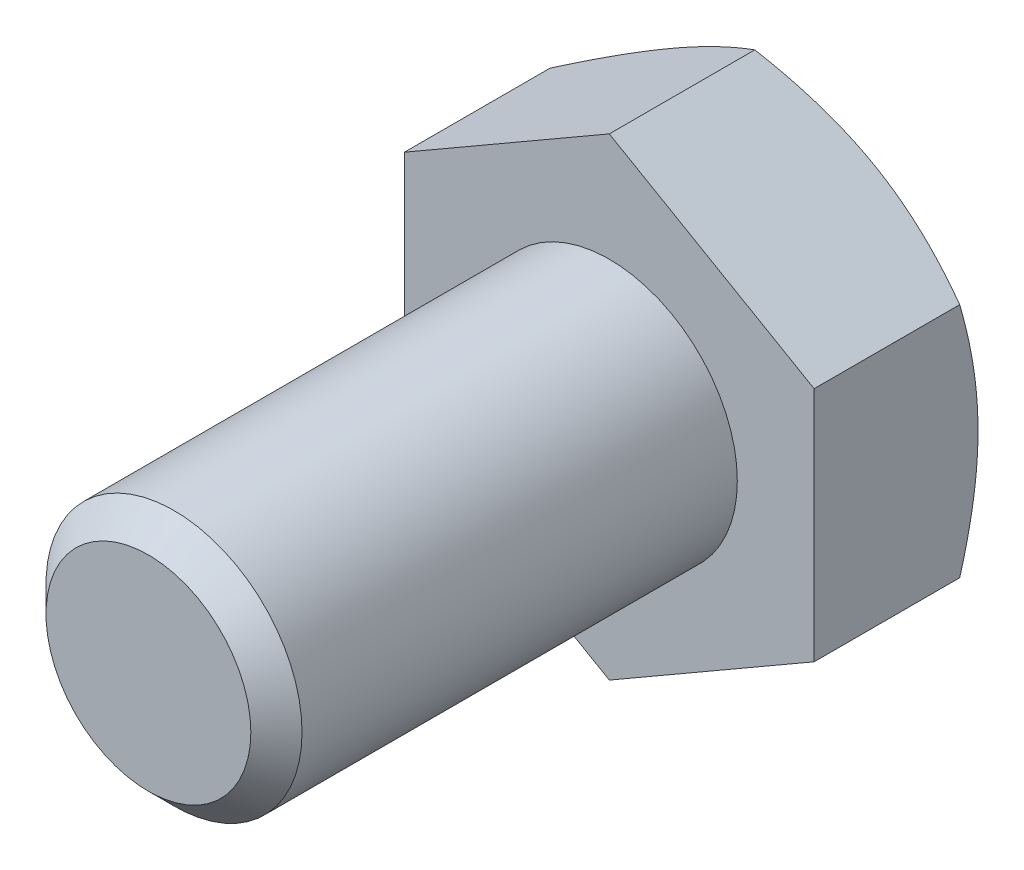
from build123d import *

# Parameters (mm, degrees)
ESQUISSE1_W        = 5
ESQUISSE1_H        = 18
CHANFREIN1_SIZE    = 1
BOSS_EXTRU_1_DEPTH = 6.4


with BuildPart() as part:
    # Esquisse1 → Base-R_volution (revolve)
    with BuildSketch(Plane(origin=(0, 0, 0), x_dir=(1, 0, 0), z_dir=(0, 1, 0))):
        with Locations((2.5, -9)):
            Rectangle(ESQUISSE1_W, ESQUISSE1_H)
    revolve(axis=Axis((0, 0, 0), (0, 0, 1)))

    # Chanfrein1
    chanfrein1_edges = [part.edges().sort_by_distance(p)[0] for p in [
        (-5, 0, 18),
    ]]
    chamfer(chanfrein1_edges, length=CHANFREIN1_SIZE)

    # Esquisse6 → Boss.-Extru.1 (add)
    with BuildSketch(Plane.XY):
        Polygon((8, -4.618802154), (8, 4.618802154), (0, 9.237604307), (-8, 4.618802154), (-8, -4.618802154), (0, -9.237604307), align=None)
    extrude(amount=-BOSS_EXTRU_1_DEPTH)

    # Esquisse7 → Enl_vement de mati_re-R_volution1 (revolve, cut)
    with BuildSketch(Plane(origin=(0, 0, 0), x_dir=(1, 0, 0), z_dir=(0, 1, 0))):
        Polygon((-8, 6.4), (-19.085125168, 6.4), (-19.085125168, 0), align=None)
    revolve(axis=Axis((0, 0, -6.239446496), (0, 0, 1)), mode=Mode.SUBTRACT)


solid = part.part
